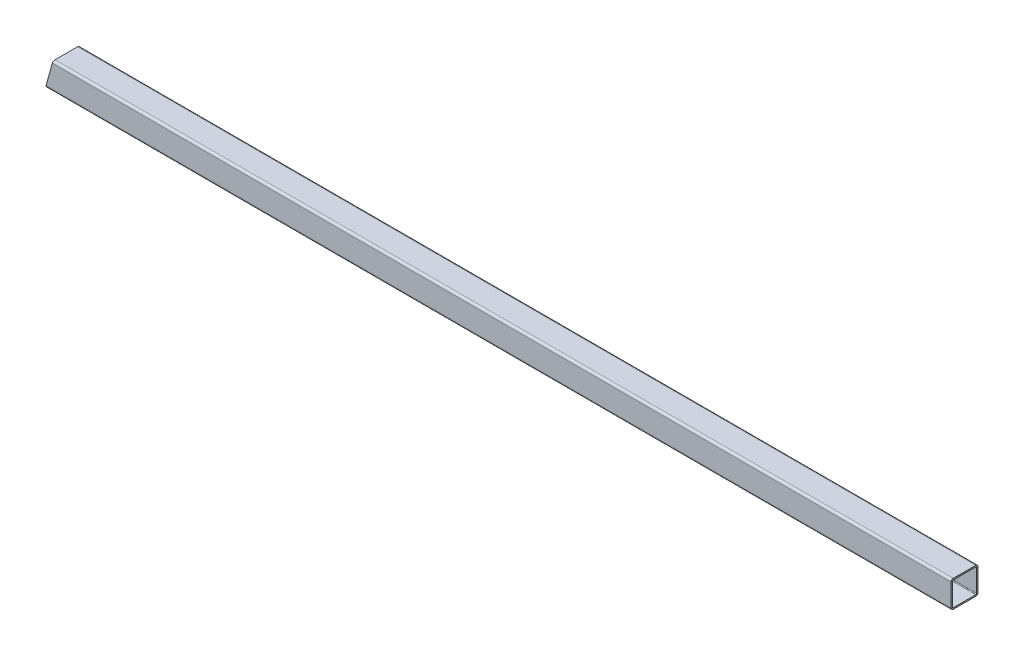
from build123d import *

# Parameters (mm, degrees)
BOSS_EXTRUDE1_DEPTH = 1320.8
SCALE2_SCALE_X      = 1
SCALE2_SCALE_Y      = 0.4
SCALE2_SCALE_Z      = 0.4
CUT_EXTRUDE1_DEPTH  = 1322.04802369


with BuildPart() as part:
    # Sketch1 → Boss-Extrude1 (new body)
    with BuildSketch(Plane(origin=(0, 0, 0), x_dir=(0, 0, -1), z_dir=(1, 0, 0))):
        with BuildLine():
            Line((0, 2.54), (0, 29.21))
            ThreePointArc((0, 29.21), (-0.743948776, 31.006051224), (-2.54, 31.75))
            Line((-2.54, 31.75), (-29.21, 31.75))
            ThreePointArc((-29.21, 31.75), (-31.006051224, 31.006051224), (-31.75, 29.21))
            Line((-31.75, 29.21), (-31.75, 2.54))
            ThreePointArc((-31.75, 2.54), (-31.006051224, 0.743948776), (-29.21, 0))
            Line((-29.21, 0), (-2.54, 0))
            ThreePointArc((-2.54, 0), (-0.743948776, 0.743948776), (0, 2.54))
        make_face()
        with BuildLine():
            Line((-1.651, 2.54), (-1.651, 29.21))
            ThreePointArc((-1.651, 29.21), (-1.911382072, 29.838617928), (-2.54, 30.099))
            Line((-2.54, 30.099), (-29.21, 30.099))
            ThreePointArc((-29.21, 30.099), (-29.838617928, 29.838617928), (-30.099, 29.21))
            Line((-30.099, 29.21), (-30.099, 2.54))
            ThreePointArc((-30.099, 2.54), (-29.838617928, 1.911382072), (-29.21, 1.651))
            Line((-29.21, 1.651), (-2.54, 1.651))
            ThreePointArc((-2.54, 1.651), (-1.911382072, 1.911382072), (-1.651, 2.54))
        make_face(mode=Mode.SUBTRACT)
    extrude(amount=BOSS_EXTRUDE1_DEPTH)


with BuildPart() as part_1:
    # Scale2: scaled about (660.4, 15.875, 15.875)
    add(part.part.scale((SCALE2_SCALE_X, SCALE2_SCALE_Y, SCALE2_SCALE_Z), about=(660.4, 15.875, 15.875)))

    # Sketch3 → Cut-Extrude1 (cut, through all)
    with BuildSketch(Plane.XY.offset(22.225)):
        Polygon((896.418706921, 23.381400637), (892.126705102, 7.844354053), (-50.587944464, -33.839617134), (60.044186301, 138.203660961), align=None)
    extrude(amount=-CUT_EXTRUDE1_DEPTH, mode=Mode.SUBTRACT)


solid = part_1.part
